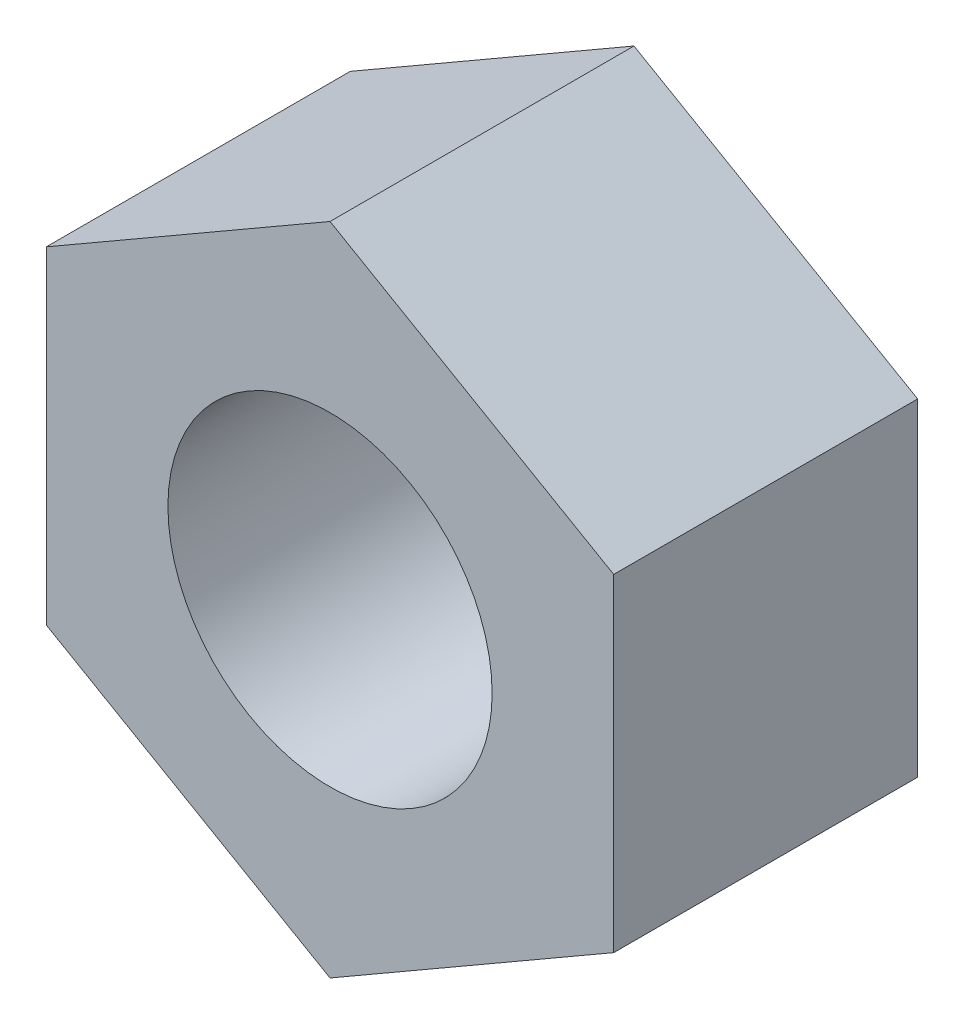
ISO-10303-21;
HEADER;
FILE_DESCRIPTION(('STEP AP214'),'2;1');
FILE_NAME('part.step','',(''),(''),'','','');
FILE_SCHEMA(('AUTOMOTIVE_DESIGN { 1 0 10303 214 1 1 1 1 }'));
ENDSEC;
DATA;
#1=APPLICATION_CONTEXT('core data for automotive mechanical design processes');
#2=APPLICATION_PROTOCOL_DEFINITION('international standard','automotive_design',2000,#1);
#3=PRODUCT_CONTEXT('',#1,'mechanical');
#4=PRODUCT('Part','Part','',(#3));
#5=PRODUCT_RELATED_PRODUCT_CATEGORY('part','',(#4));
#6=PRODUCT_DEFINITION_FORMATION('','',#4);
#7=PRODUCT_DEFINITION_CONTEXT('part definition',#1,'design');
#8=PRODUCT_DEFINITION('design','',#6,#7);
#9=PRODUCT_DEFINITION_SHAPE('','',#8);
#10=(LENGTH_UNIT() NAMED_UNIT(*) SI_UNIT(.MILLI.,.METRE.));
#11=(NAMED_UNIT(*) PLANE_ANGLE_UNIT() SI_UNIT($,.RADIAN.));
#12=(NAMED_UNIT(*) SI_UNIT($,.STERADIAN.) SOLID_ANGLE_UNIT());
#13=UNCERTAINTY_MEASURE_WITH_UNIT(LENGTH_MEASURE(1.E-05),#10,'distance_accuracy_value','');
#14=(GEOMETRIC_REPRESENTATION_CONTEXT(3) GLOBAL_UNCERTAINTY_ASSIGNED_CONTEXT((#13)) GLOBAL_UNIT_ASSIGNED_CONTEXT((#10,
#11,#12)) REPRESENTATION_CONTEXT('',''));
#15=CARTESIAN_POINT('',(0.,0.,0.));
#16=DIRECTION('',(0.,0.,1.));
#17=DIRECTION('',(1.,0.,0.));
#18=AXIS2_PLACEMENT_3D('',#15,#16,#17);
#19=CARTESIAN_POINT('',(14.,-8.08290376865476,15.));
#20=DIRECTION('',(-1.,0.,0.));
#21=DIRECTION('',(0.,-1.,0.));
#22=AXIS2_PLACEMENT_3D('',#19,#20,#21);
#23=PLANE('',#22);
#24=DIRECTION('',(0.,1.,0.));
#25=VECTOR('',#24,1.);
#26=CARTESIAN_POINT('',(14.,-8.08290376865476,0.));
#27=LINE('',#26,#25);
#28=CARTESIAN_POINT('',(14.,-8.08290376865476,0.));
#29=VERTEX_POINT('',#28);
#30=CARTESIAN_POINT('',(14.,8.08290376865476,0.));
#31=VERTEX_POINT('',#30);
#32=EDGE_CURVE('E117',#29,#31,#27,.T.);
#33=ORIENTED_EDGE('',*,*,#32,.T.);
#34=DIRECTION('',(0.,0.,-1.));
#35=VECTOR('',#34,1.);
#36=CARTESIAN_POINT('',(14.,8.08290376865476,15.));
#37=LINE('',#36,#35);
#38=CARTESIAN_POINT('',(14.,8.08290376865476,15.));
#39=VERTEX_POINT('',#38);
#40=EDGE_CURVE('E11',#39,#31,#37,.T.);
#41=ORIENTED_EDGE('',*,*,#40,.F.);
#42=DIRECTION('',(0.,1.,0.));
#43=VECTOR('',#42,1.);
#44=CARTESIAN_POINT('',(14.,-8.08290376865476,15.));
#45=LINE('',#44,#43);
#46=CARTESIAN_POINT('',(14.,-8.08290376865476,15.));
#47=VERTEX_POINT('',#46);
#48=EDGE_CURVE('E128',#47,#39,#45,.T.);
#49=ORIENTED_EDGE('',*,*,#48,.F.);
#50=DIRECTION('',(0.,0.,-1.));
#51=VECTOR('',#50,1.);
#52=CARTESIAN_POINT('',(14.,-8.08290376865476,15.));
#53=LINE('',#52,#51);
#54=EDGE_CURVE('E113',#47,#29,#53,.T.);
#55=ORIENTED_EDGE('',*,*,#54,.T.);
#56=EDGE_LOOP('',(#33,#41,#49,#55));
#57=FACE_BOUND('',#56,.T.);
#58=ADVANCED_FACE('F33',(#57),#23,.F.);
#59=CARTESIAN_POINT('',(14.,8.08290376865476,15.));
#60=DIRECTION('',(-0.5,-0.866025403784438,0.));
#61=DIRECTION('',(0.866025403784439,-0.5,0.));
#62=AXIS2_PLACEMENT_3D('',#59,#60,#61);
#63=PLANE('',#62);
#64=DIRECTION('',(-0.866025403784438,0.5,0.));
#65=VECTOR('',#64,1.);
#66=CARTESIAN_POINT('',(14.,8.08290376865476,0.));
#67=LINE('',#66,#65);
#68=CARTESIAN_POINT('',(0.,16.1658075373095,0.));
#69=VERTEX_POINT('',#68);
#70=EDGE_CURVE('E120',#31,#69,#67,.T.);
#71=ORIENTED_EDGE('',*,*,#70,.T.);
#72=DIRECTION('',(0.,0.,-1.));
#73=VECTOR('',#72,1.);
#74=CARTESIAN_POINT('',(0.,16.1658075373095,15.));
#75=LINE('',#74,#73);
#76=CARTESIAN_POINT('',(0.,16.1658075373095,15.));
#77=VERTEX_POINT('',#76);
#78=EDGE_CURVE('E41',#77,#69,#75,.T.);
#79=ORIENTED_EDGE('',*,*,#78,.F.);
#80=DIRECTION('',(-0.866025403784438,0.5,0.));
#81=VECTOR('',#80,1.);
#82=CARTESIAN_POINT('',(14.,8.08290376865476,15.));
#83=LINE('',#82,#81);
#84=EDGE_CURVE('E86',#39,#77,#83,.T.);
#85=ORIENTED_EDGE('',*,*,#84,.F.);
#86=ORIENTED_EDGE('',*,*,#40,.T.);
#87=EDGE_LOOP('',(#71,#79,#85,#86));
#88=FACE_BOUND('',#87,.T.);
#89=ADVANCED_FACE('F153',(#88),#63,.F.);
#90=CARTESIAN_POINT('',(0.,16.1658075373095,15.));
#91=DIRECTION('',(0.5,-0.866025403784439,0.));
#92=DIRECTION('',(0.866025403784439,0.5,0.));
#93=AXIS2_PLACEMENT_3D('',#90,#91,#92);
#94=PLANE('',#93);
#95=DIRECTION('',(-0.866025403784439,-0.5,0.));
#96=VECTOR('',#95,1.);
#97=CARTESIAN_POINT('',(0.,16.1658075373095,0.));
#98=LINE('',#97,#96);
#99=CARTESIAN_POINT('',(-14.,8.08290376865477,0.));
#100=VERTEX_POINT('',#99);
#101=EDGE_CURVE('E123',#69,#100,#98,.T.);
#102=ORIENTED_EDGE('',*,*,#101,.T.);
#103=DIRECTION('',(0.,0.,-1.));
#104=VECTOR('',#103,1.);
#105=CARTESIAN_POINT('',(-14.,8.08290376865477,15.));
#106=LINE('',#105,#104);
#107=CARTESIAN_POINT('',(-14.,8.08290376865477,15.));
#108=VERTEX_POINT('',#107);
#109=EDGE_CURVE('E108',#108,#100,#106,.T.);
#110=ORIENTED_EDGE('',*,*,#109,.F.);
#111=DIRECTION('',(-0.866025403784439,-0.5,0.));
#112=VECTOR('',#111,1.);
#113=CARTESIAN_POINT('',(0.,16.1658075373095,15.));
#114=LINE('',#113,#112);
#115=EDGE_CURVE('E99',#77,#108,#114,.T.);
#116=ORIENTED_EDGE('',*,*,#115,.F.);
#117=ORIENTED_EDGE('',*,*,#78,.T.);
#118=EDGE_LOOP('',(#102,#110,#116,#117));
#119=FACE_BOUND('',#118,.T.);
#120=ADVANCED_FACE('F134',(#119),#94,.F.);
#121=CARTESIAN_POINT('',(-14.,8.08290376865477,15.));
#122=DIRECTION('',(1.,0.,0.));
#123=DIRECTION('',(0.,1.,0.));
#124=AXIS2_PLACEMENT_3D('',#121,#122,#123);
#125=PLANE('',#124);
#126=DIRECTION('',(0.,-1.,0.));
#127=VECTOR('',#126,1.);
#128=CARTESIAN_POINT('',(-14.,8.08290376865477,0.));
#129=LINE('',#128,#127);
#130=CARTESIAN_POINT('',(-14.,-8.08290376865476,0.));
#131=VERTEX_POINT('',#130);
#132=EDGE_CURVE('E107',#100,#131,#129,.T.);
#133=ORIENTED_EDGE('',*,*,#132,.T.);
#134=DIRECTION('',(0.,0.,-1.));
#135=VECTOR('',#134,1.);
#136=CARTESIAN_POINT('',(-14.,-8.08290376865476,15.));
#137=LINE('',#136,#135);
#138=CARTESIAN_POINT('',(-14.,-8.08290376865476,15.));
#139=VERTEX_POINT('',#138);
#140=EDGE_CURVE('E104',#139,#131,#137,.T.);
#141=ORIENTED_EDGE('',*,*,#140,.F.);
#142=DIRECTION('',(0.,-1.,0.));
#143=VECTOR('',#142,1.);
#144=CARTESIAN_POINT('',(-14.,8.08290376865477,15.));
#145=LINE('',#144,#143);
#146=EDGE_CURVE('E93',#108,#139,#145,.T.);
#147=ORIENTED_EDGE('',*,*,#146,.F.);
#148=ORIENTED_EDGE('',*,*,#109,.T.);
#149=EDGE_LOOP('',(#133,#141,#147,#148));
#150=FACE_BOUND('',#149,.T.);
#151=ADVANCED_FACE('F105',(#150),#125,.F.);
#152=CARTESIAN_POINT('',(-14.,-8.08290376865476,15.));
#153=DIRECTION('',(0.5,0.866025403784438,0.));
#154=DIRECTION('',(-0.866025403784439,0.5,0.));
#155=AXIS2_PLACEMENT_3D('',#152,#153,#154);
#156=PLANE('',#155);
#157=DIRECTION('',(0.866025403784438,-0.5,0.));
#158=VECTOR('',#157,1.);
#159=CARTESIAN_POINT('',(-14.,-8.08290376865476,0.));
#160=LINE('',#159,#158);
#161=CARTESIAN_POINT('',(0.,-16.1658075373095,0.));
#162=VERTEX_POINT('',#161);
#163=EDGE_CURVE('E72',#131,#162,#160,.T.);
#164=ORIENTED_EDGE('',*,*,#163,.T.);
#165=DIRECTION('',(0.,0.,-1.));
#166=VECTOR('',#165,1.);
#167=CARTESIAN_POINT('',(0.,-16.1658075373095,15.));
#168=LINE('',#167,#166);
#169=CARTESIAN_POINT('',(0.,-16.1658075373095,15.));
#170=VERTEX_POINT('',#169);
#171=EDGE_CURVE('E109',#170,#162,#168,.T.);
#172=ORIENTED_EDGE('',*,*,#171,.F.);
#173=DIRECTION('',(0.866025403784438,-0.5,0.));
#174=VECTOR('',#173,1.);
#175=CARTESIAN_POINT('',(-14.,-8.08290376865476,15.));
#176=LINE('',#175,#174);
#177=EDGE_CURVE('E97',#139,#170,#176,.T.);
#178=ORIENTED_EDGE('',*,*,#177,.F.);
#179=ORIENTED_EDGE('',*,*,#140,.T.);
#180=EDGE_LOOP('',(#164,#172,#178,#179));
#181=FACE_BOUND('',#180,.T.);
#182=ADVANCED_FACE('F111',(#181),#156,.F.);
#183=CARTESIAN_POINT('',(0.,-16.1658075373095,15.));
#184=DIRECTION('',(-0.5,0.866025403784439,0.));
#185=DIRECTION('',(-0.866025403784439,-0.5,0.));
#186=AXIS2_PLACEMENT_3D('',#183,#184,#185);
#187=PLANE('',#186);
#188=DIRECTION('',(0.866025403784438,0.5,0.));
#189=VECTOR('',#188,1.);
#190=CARTESIAN_POINT('',(0.,-16.1658075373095,0.));
#191=LINE('',#190,#189);
#192=EDGE_CURVE('E78',#162,#29,#191,.T.);
#193=ORIENTED_EDGE('',*,*,#192,.T.);
#194=ORIENTED_EDGE('',*,*,#54,.F.);
#195=DIRECTION('',(0.866025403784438,0.5,0.));
#196=VECTOR('',#195,1.);
#197=CARTESIAN_POINT('',(0.,-16.1658075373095,15.));
#198=LINE('',#197,#196);
#199=EDGE_CURVE('E49',#170,#47,#198,.T.);
#200=ORIENTED_EDGE('',*,*,#199,.F.);
#201=ORIENTED_EDGE('',*,*,#171,.T.);
#202=EDGE_LOOP('',(#193,#194,#200,#201));
#203=FACE_BOUND('',#202,.T.);
#204=ADVANCED_FACE('F141',(#203),#187,.F.);
#205=CARTESIAN_POINT('',(0.,0.,15.));
#206=DIRECTION('',(0.,0.,1.));
#207=DIRECTION('',(1.,0.,0.));
#208=AXIS2_PLACEMENT_3D('',#205,#206,#207);
#209=PLANE('',#208);
#210=CARTESIAN_POINT('',(0.,0.,15.));
#211=DIRECTION('',(0.,0.,-1.));
#212=DIRECTION('',(-1.,0.,0.));
#213=AXIS2_PLACEMENT_3D('',#210,#211,#212);
#214=CIRCLE('',#213,8.);
#215=CARTESIAN_POINT('',(-8.,0.,15.));
#216=VERTEX_POINT('',#215);
#217=EDGE_CURVE('E121',#216,#216,#214,.T.);
#218=ORIENTED_EDGE('',*,*,#217,.T.);
#219=EDGE_LOOP('',(#218));
#220=FACE_BOUND('',#219,.T.);
#221=ORIENTED_EDGE('',*,*,#48,.T.);
#222=ORIENTED_EDGE('',*,*,#84,.T.);
#223=ORIENTED_EDGE('',*,*,#115,.T.);
#224=ORIENTED_EDGE('',*,*,#146,.T.);
#225=ORIENTED_EDGE('',*,*,#177,.T.);
#226=ORIENTED_EDGE('',*,*,#199,.T.);
#227=EDGE_LOOP('',(#221,#222,#223,#224,#225,#226));
#228=FACE_BOUND('',#227,.T.);
#229=ADVANCED_FACE('F95',(#220,#228),#209,.T.);
#230=CARTESIAN_POINT('',(0.,0.,0.));
#231=DIRECTION('',(0.,0.,1.));
#232=DIRECTION('',(1.,0.,0.));
#233=AXIS2_PLACEMENT_3D('',#230,#231,#232);
#234=PLANE('',#233);
#235=CARTESIAN_POINT('',(0.,0.,0.));
#236=DIRECTION('',(0.,0.,-1.));
#237=DIRECTION('',(-1.,0.,0.));
#238=AXIS2_PLACEMENT_3D('',#235,#236,#237);
#239=CIRCLE('',#238,8.);
#240=CARTESIAN_POINT('',(-8.,0.,0.));
#241=VERTEX_POINT('',#240);
#242=EDGE_CURVE('E208',#241,#241,#239,.T.);
#243=ORIENTED_EDGE('',*,*,#242,.F.);
#244=EDGE_LOOP('',(#243));
#245=FACE_BOUND('',#244,.T.);
#246=ORIENTED_EDGE('',*,*,#32,.F.);
#247=ORIENTED_EDGE('',*,*,#192,.F.);
#248=ORIENTED_EDGE('',*,*,#163,.F.);
#249=ORIENTED_EDGE('',*,*,#132,.F.);
#250=ORIENTED_EDGE('',*,*,#101,.F.);
#251=ORIENTED_EDGE('',*,*,#70,.F.);
#252=EDGE_LOOP('',(#246,#247,#248,#249,#250,#251));
#253=FACE_BOUND('',#252,.T.);
#254=ADVANCED_FACE('F137',(#245,#253),#234,.F.);
#255=CARTESIAN_POINT('',(0.,0.,15.));
#256=DIRECTION('',(0.,0.,-1.));
#257=DIRECTION('',(-1.,0.,0.));
#258=AXIS2_PLACEMENT_3D('',#255,#256,#257);
#259=CYLINDRICAL_SURFACE('',#258,8.);
#260=ORIENTED_EDGE('',*,*,#217,.F.);
#261=EDGE_LOOP('',(#260));
#262=FACE_BOUND('',#261,.T.);
#263=ORIENTED_EDGE('',*,*,#242,.T.);
#264=EDGE_LOOP('',(#263));
#265=FACE_BOUND('',#264,.T.);
#266=ADVANCED_FACE('F190',(#262,#265),#259,.F.);
#267=CLOSED_SHELL('',(#58,#89,#120,#151,#182,#204,#229,#254,#266));
#268=MANIFOLD_SOLID_BREP('B2',#267);
#269=ADVANCED_BREP_SHAPE_REPRESENTATION('',(#18,#268),#14);
#270=SHAPE_DEFINITION_REPRESENTATION(#9,#269);
ENDSEC;
END-ISO-10303-21;
